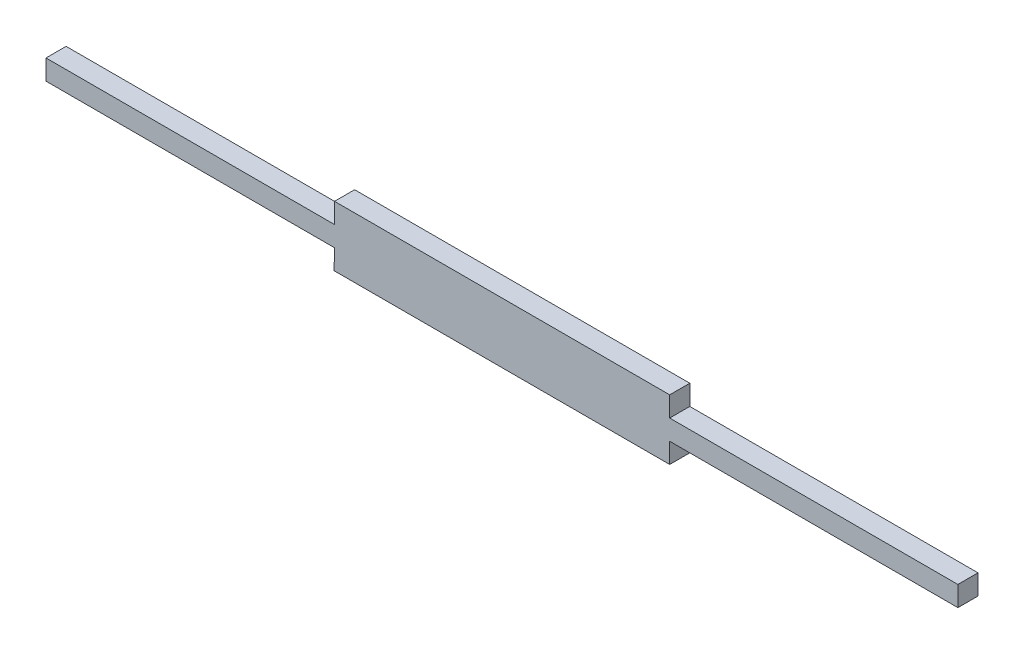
from build123d import *

# Parameters (mm, degrees)
BOSS_EXTRUDE1_DEPTH = 1.524


with BuildPart() as part:
    # Sketch1 → Boss-Extrude1 (new body)
    with BuildSketch(Plane.XY):
        Polygon((0.297252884, 4.116822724), (22.160830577, 4.116822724), (22.128497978, 2.592822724), (47.560830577, 2.592822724), (47.560830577, 4.116822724), (69.400497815, 4.116822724), (69.400497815, 5.640822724), (47.560830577, 5.640822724), (47.560830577, 7.164822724), (22.160830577, 7.164822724), (22.160830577, 5.640822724), (0.297252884, 5.640822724), align=None)
    extrude(amount=BOSS_EXTRUDE1_DEPTH)


solid = part.part
